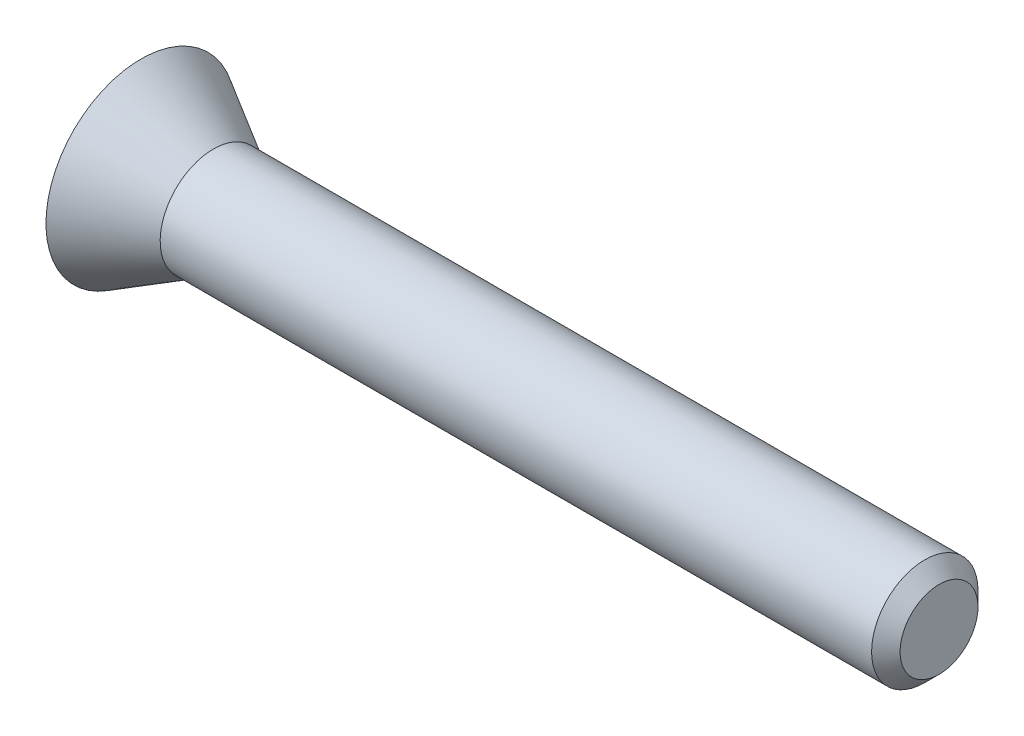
ISO-10303-21;
HEADER;
FILE_DESCRIPTION(('STEP AP214'),'2;1');
FILE_NAME('part.step','',(''),(''),'','','');
FILE_SCHEMA(('AUTOMOTIVE_DESIGN { 1 0 10303 214 1 1 1 1 }'));
ENDSEC;
DATA;
#1=APPLICATION_CONTEXT('core data for automotive mechanical design processes');
#2=APPLICATION_PROTOCOL_DEFINITION('international standard','automotive_design',2000,#1);
#3=PRODUCT_CONTEXT('',#1,'mechanical');
#4=PRODUCT('Part','Part','',(#3));
#5=PRODUCT_RELATED_PRODUCT_CATEGORY('part','',(#4));
#6=PRODUCT_DEFINITION_FORMATION('','',#4);
#7=PRODUCT_DEFINITION_CONTEXT('part definition',#1,'design');
#8=PRODUCT_DEFINITION('design','',#6,#7);
#9=PRODUCT_DEFINITION_SHAPE('','',#8);
#10=(LENGTH_UNIT() NAMED_UNIT(*) SI_UNIT(.MILLI.,.METRE.));
#11=(NAMED_UNIT(*) PLANE_ANGLE_UNIT() SI_UNIT($,.RADIAN.));
#12=(NAMED_UNIT(*) SI_UNIT($,.STERADIAN.) SOLID_ANGLE_UNIT());
#13=UNCERTAINTY_MEASURE_WITH_UNIT(LENGTH_MEASURE(1.E-05),#10,'distance_accuracy_value','');
#14=(GEOMETRIC_REPRESENTATION_CONTEXT(3) GLOBAL_UNCERTAINTY_ASSIGNED_CONTEXT((#13)) GLOBAL_UNIT_ASSIGNED_CONTEXT((#10,
#11,#12)) REPRESENTATION_CONTEXT('',''));
#15=CARTESIAN_POINT('',(0.,0.,0.));
#16=DIRECTION('',(0.,0.,1.));
#17=DIRECTION('',(1.,0.,0.));
#18=AXIS2_PLACEMENT_3D('',#15,#16,#17);
#19=CARTESIAN_POINT('',(-5.25,0.,0.));
#20=DIRECTION('',(1.,0.,0.));
#21=DIRECTION('',(0.,0.,-1.));
#22=AXIS2_PLACEMENT_3D('',#19,#20,#21);
#23=PLANE('',#22);
#24=DIRECTION('',(0.,-1.,0.));
#25=VECTOR('',#24,1.);
#26=CARTESIAN_POINT('',(-5.25,0.4,-0.846897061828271));
#27=LINE('',#26,#25);
#28=CARTESIAN_POINT('',(-5.25,0.4,-0.846897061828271));
#29=VERTEX_POINT('',#28);
#30=CARTESIAN_POINT('',(-5.25,0.274594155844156,-0.846897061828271));
#31=VERTEX_POINT('',#30);
#32=EDGE_CURVE('E300',#29,#31,#27,.T.);
#33=ORIENTED_EDGE('',*,*,#32,.F.);
#34=DIRECTION('',(0.,0.,-1.));
#35=VECTOR('',#34,1.);
#36=CARTESIAN_POINT('',(-5.25,0.4,-0.277903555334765));
#37=LINE('',#36,#35);
#38=CARTESIAN_POINT('',(-5.25,0.4,-0.277903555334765));
#39=VERTEX_POINT('',#38);
#40=EDGE_CURVE('E56',#39,#29,#37,.T.);
#41=ORIENTED_EDGE('',*,*,#40,.F.);
#42=DIRECTION('',(0.,1.,0.));
#43=VECTOR('',#42,1.);
#44=CARTESIAN_POINT('',(-5.25,0.0623376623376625,-0.277903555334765));
#45=LINE('',#44,#43);
#46=CARTESIAN_POINT('',(-5.25,0.0623376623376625,-0.277903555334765));
#47=VERTEX_POINT('',#46);
#48=EDGE_CURVE('E277',#47,#39,#45,.T.);
#49=ORIENTED_EDGE('',*,*,#48,.F.);
#50=DIRECTION('',(0.,0.,1.));
#51=VECTOR('',#50,1.);
#52=CARTESIAN_POINT('',(-5.25,0.0623376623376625,-0.465606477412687));
#53=LINE('',#52,#51);
#54=CARTESIAN_POINT('',(-5.25,0.0623376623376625,-0.465606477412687));
#55=VERTEX_POINT('',#54);
#56=EDGE_CURVE('E280',#55,#47,#53,.T.);
#57=ORIENTED_EDGE('',*,*,#56,.F.);
#58=DIRECTION('',(0.,-1.,0.));
#59=VECTOR('',#58,1.);
#60=CARTESIAN_POINT('',(-5.25,0.218181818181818,-0.465606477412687));
#61=LINE('',#60,#59);
#62=CARTESIAN_POINT('',(-5.25,0.218181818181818,-0.465606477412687));
#63=VERTEX_POINT('',#62);
#64=EDGE_CURVE('E314',#63,#55,#61,.T.);
#65=ORIENTED_EDGE('',*,*,#64,.F.);
#66=DIRECTION('',(0.,0.,1.));
#67=VECTOR('',#66,1.);
#68=CARTESIAN_POINT('',(-5.25,0.218181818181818,-0.636669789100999));
#69=LINE('',#68,#67);
#70=CARTESIAN_POINT('',(-5.25,0.218181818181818,-0.636669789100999));
#71=VERTEX_POINT('',#70);
#72=EDGE_CURVE('E311',#71,#63,#69,.T.);
#73=ORIENTED_EDGE('',*,*,#72,.F.);
#74=DIRECTION('',(0.,0.966781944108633,-0.255602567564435));
#75=VECTOR('',#74,1.);
#76=CARTESIAN_POINT('',(-5.25,-0.6,-0.420354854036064));
#77=LINE('',#76,#75);
#78=CARTESIAN_POINT('',(-5.25,-0.6,-0.420354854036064));
#79=VERTEX_POINT('',#78);
#80=EDGE_CURVE('E308',#79,#71,#77,.T.);
#81=ORIENTED_EDGE('',*,*,#80,.F.);
#82=DIRECTION('',(0.,0.,1.));
#83=VECTOR('',#82,1.);
#84=CARTESIAN_POINT('',(-5.25,-0.6,-0.623682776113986));
#85=LINE('',#84,#83);
#86=CARTESIAN_POINT('',(-5.25,-0.6,-0.623682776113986));
#87=VERTEX_POINT('',#86);
#88=EDGE_CURVE('E305',#87,#79,#85,.T.);
#89=ORIENTED_EDGE('',*,*,#88,.F.);
#90=DIRECTION('',(0.,-0.968940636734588,0.247293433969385));
#91=VECTOR('',#90,1.);
#92=CARTESIAN_POINT('',(-5.25,0.274594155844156,-0.846897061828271));
#93=LINE('',#92,#91);
#94=EDGE_CURVE('E302',#31,#87,#93,.T.);
#95=ORIENTED_EDGE('',*,*,#94,.F.);
#96=EDGE_LOOP('',(#33,#41,#49,#57,#65,#73,#81,#89,#95));
#97=FACE_BOUND('',#96,.T.);
#98=DIRECTION('',(0.,1.,0.));
#99=VECTOR('',#98,1.);
#100=CARTESIAN_POINT('',(-5.25,-0.6,0.88127663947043));
#101=LINE('',#100,#99);
#102=CARTESIAN_POINT('',(-5.25,-0.6,0.88127663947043));
#103=VERTEX_POINT('',#102);
#104=CARTESIAN_POINT('',(-5.25,-0.429951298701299,0.88127663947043));
#105=VERTEX_POINT('',#104);
#106=EDGE_CURVE('E429',#103,#105,#101,.T.);
#107=ORIENTED_EDGE('',*,*,#106,.F.);
#108=DIRECTION('',(0.,0.,1.));
#109=VECTOR('',#108,1.);
#110=CARTESIAN_POINT('',(-5.25,-0.6,0.292396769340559));
#111=LINE('',#110,#109);
#112=CARTESIAN_POINT('',(-5.25,-0.6,0.292396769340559));
#113=VERTEX_POINT('',#112);
#114=EDGE_CURVE('E64',#113,#103,#111,.T.);
#115=ORIENTED_EDGE('',*,*,#114,.F.);
#116=DIRECTION('',(0.,-1.,0.));
#117=VECTOR('',#116,1.);
#118=CARTESIAN_POINT('',(-5.25,-0.418181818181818,0.292396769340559));
#119=LINE('',#118,#117);
#120=CARTESIAN_POINT('',(-5.25,-0.418181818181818,0.292396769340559));
#121=VERTEX_POINT('',#120);
#122=EDGE_CURVE('E338',#121,#113,#119,.T.);
#123=ORIENTED_EDGE('',*,*,#122,.F.);
#124=DIRECTION('',(0.,0.,-1.));
#125=VECTOR('',#124,1.);
#126=CARTESIAN_POINT('',(-5.25,-0.418181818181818,0.632697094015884));
#127=LINE('',#126,#125);
#128=CARTESIAN_POINT('',(-5.25,-0.418181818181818,0.632697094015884));
#129=VERTEX_POINT('',#128);
#130=EDGE_CURVE('E537',#129,#121,#127,.T.);
#131=ORIENTED_EDGE('',*,*,#130,.F.);
#132=DIRECTION('',(0.,-0.78603413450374,0.618183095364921));
#133=VECTOR('',#132,1.);
#134=CARTESIAN_POINT('',(-5.25,-0.106493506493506,0.387567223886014));
#135=LINE('',#134,#133);
#136=CARTESIAN_POINT('',(-5.25,-0.106493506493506,0.387567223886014));
#137=VERTEX_POINT('',#136);
#138=EDGE_CURVE('E540',#137,#129,#135,.T.);
#139=ORIENTED_EDGE('',*,*,#138,.F.);
#140=CARTESIAN_POINT('',(-5.25,0.150811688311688,0.297875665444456));
#141=CARTESIAN_POINT('',(-5.25,0.13943354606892,0.298134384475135));
#142=CARTESIAN_POINT('',(-5.25,0.116657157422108,0.298652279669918));
#143=CARTESIAN_POINT('',(-5.25,0.0825691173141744,0.303327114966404));
#144=CARTESIAN_POINT('',(-5.25,0.048655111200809,0.310860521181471));
#145=CARTESIAN_POINT('',(-5.25,0.0150789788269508,0.321206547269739));
#146=CARTESIAN_POINT('',(-5.25,-0.017577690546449,0.334058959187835));
#147=CARTESIAN_POINT('',(-5.25,-0.0488676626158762,0.349484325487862));
#148=CARTESIAN_POINT('',(-5.25,-0.0788047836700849,0.366893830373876));
#149=CARTESIAN_POINT('',(-5.25,-0.0972816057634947,0.380689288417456));
#150=CARTESIAN_POINT('',(-5.25,-0.106493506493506,0.387567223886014));
#151=B_SPLINE_CURVE_WITH_KNOTS('',3,(#140,#141,#142,#143,#144,#145,#146,#147,#148,#149,#150),
.UNSPECIFIED.,.F.,.F.,(4,1,1,1,1,1,1,1,4),(0.,0.123046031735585,0.246309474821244,
0.371480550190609,0.498560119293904,0.626024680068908,0.750715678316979,0.875715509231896,1.),.UNSPECIFIED.);
#152=CARTESIAN_POINT('',(-5.25,0.150811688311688,0.297875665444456));
#153=VERTEX_POINT('',#152);
#154=EDGE_CURVE('E543',#153,#137,#151,.T.);
#155=ORIENTED_EDGE('',*,*,#154,.F.);
#156=DIRECTION('',(0.,-1.,0.));
#157=VECTOR('',#156,1.);
#158=CARTESIAN_POINT('',(-5.25,0.151623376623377,0.297875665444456));
#159=LINE('',#158,#157);
#160=CARTESIAN_POINT('',(-5.25,0.151623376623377,0.297875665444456));
#161=VERTEX_POINT('',#160);
#162=EDGE_CURVE('E548',#161,#153,#159,.T.);
#163=ORIENTED_EDGE('',*,*,#162,.F.);
#164=CARTESIAN_POINT('',(-5.25,0.412987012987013,0.592315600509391));
#165=CARTESIAN_POINT('',(-5.25,0.412825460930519,0.580942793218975));
#166=CARTESIAN_POINT('',(-5.25,0.412511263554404,0.55882418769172));
#167=CARTESIAN_POINT('',(-5.25,0.409119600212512,0.526623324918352));
#168=CARTESIAN_POINT('',(-5.25,0.404000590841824,0.496325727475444));
#169=CARTESIAN_POINT('',(-5.25,0.396511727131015,0.46798014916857));
#170=CARTESIAN_POINT('',(-5.25,0.386743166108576,0.441700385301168));
#171=CARTESIAN_POINT('',(-5.25,0.374964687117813,0.417407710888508));
#172=CARTESIAN_POINT('',(-5.25,0.361075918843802,0.39505134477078));
#173=CARTESIAN_POINT('',(-5.25,0.345047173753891,0.374802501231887));
#174=CARTESIAN_POINT('',(-5.25,0.327169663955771,0.356583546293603));
#175=CARTESIAN_POINT('',(-5.25,0.307261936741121,0.340901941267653));
#176=CARTESIAN_POINT('',(-5.25,0.285726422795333,0.327326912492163));
#177=CARTESIAN_POINT('',(-5.25,0.262145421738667,0.31671540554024));
#178=CARTESIAN_POINT('',(-5.25,0.237073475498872,0.307979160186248));
#179=CARTESIAN_POINT('',(-5.25,0.210061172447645,0.302322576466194));
#180=CARTESIAN_POINT('',(-5.25,0.181426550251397,0.29851075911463));
#181=CARTESIAN_POINT('',(-5.25,0.161715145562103,0.298090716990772));
#182=CARTESIAN_POINT('',(-5.25,0.151623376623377,0.297875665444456));
#183=B_SPLINE_CURVE_WITH_KNOTS('',3,(#164,#165,#166,#167,#168,#169,#170,#171,#172,#173,#174,
#175,#176,#177,#178,#179,#180,#181,#182),.UNSPECIFIED.,.F.,.F.,(4,1,1,1,1,1,1,1,1,1,1,1,1,1,1,1,
4),(0.,0.0762312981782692,0.148259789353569,0.216860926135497,0.28210063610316,
0.344528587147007,0.404571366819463,0.462840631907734,0.520642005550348,0.577409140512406,
0.633580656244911,0.690215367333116,0.747647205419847,0.806597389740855,0.867894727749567,
0.932365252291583,1.),.UNSPECIFIED.);
#184=CARTESIAN_POINT('',(-5.25,0.412987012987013,0.592315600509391));
#185=VERTEX_POINT('',#184);
#186=EDGE_CURVE('E554',#185,#161,#183,.T.);
#187=ORIENTED_EDGE('',*,*,#186,.F.);
#188=CARTESIAN_POINT('',(-5.25,0.11286525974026,0.893654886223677));
#189=CARTESIAN_POINT('',(-5.25,0.1244566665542,0.892705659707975));
#190=CARTESIAN_POINT('',(-5.25,0.147082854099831,0.890852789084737));
#191=CARTESIAN_POINT('',(-5.25,0.179812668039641,0.884778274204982));
#192=CARTESIAN_POINT('',(-5.25,0.21064191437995,0.876927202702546));
#193=CARTESIAN_POINT('',(-5.25,0.239564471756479,0.866939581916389));
#194=CARTESIAN_POINT('',(-5.25,0.26624544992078,0.854105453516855));
#195=CARTESIAN_POINT('',(-5.25,0.291242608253,0.839685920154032));
#196=CARTESIAN_POINT('',(-5.25,0.313782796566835,0.82234283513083));
#197=CARTESIAN_POINT('',(-5.25,0.334620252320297,0.803358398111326));
#198=CARTESIAN_POINT('',(-5.25,0.352973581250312,0.782213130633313));
#199=CARTESIAN_POINT('',(-5.25,0.369163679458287,0.759666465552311));
#200=CARTESIAN_POINT('',(-5.25,0.382636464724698,0.735377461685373));
#201=CARTESIAN_POINT('',(-5.25,0.393812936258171,0.709715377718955));
#202=CARTESIAN_POINT('',(-5.25,0.402295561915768,0.682395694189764));
#203=CARTESIAN_POINT('',(-5.25,0.408649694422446,0.653775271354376));
#204=CARTESIAN_POINT('',(-5.25,0.412314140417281,0.623525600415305));
#205=CARTESIAN_POINT('',(-5.25,0.412759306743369,0.602877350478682));
#206=CARTESIAN_POINT('',(-5.25,0.412987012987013,0.592315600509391));
#207=B_SPLINE_CURVE_WITH_KNOTS('',3,(#188,#189,#190,#191,#192,#193,#194,#195,#196,#197,#198,
#199,#200,#201,#202,#203,#204,#205,#206),.UNSPECIFIED.,.F.,.F.,(4,1,1,1,1,1,1,1,1,1,1,1,1,1,1,1,
4),(0.,0.0733268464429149,0.143132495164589,0.209679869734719,0.273918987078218,
0.33576228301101,0.396210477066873,0.45560885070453,0.514796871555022,0.573764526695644,
0.631900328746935,0.689592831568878,0.748648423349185,0.808163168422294,0.86976604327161,
0.933384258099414,1.),.UNSPECIFIED.);
#208=CARTESIAN_POINT('',(-5.25,0.11286525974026,0.893654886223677));
#209=VERTEX_POINT('',#208);
#210=EDGE_CURVE('E559',#209,#185,#207,.T.);
#211=ORIENTED_EDGE('',*,*,#210,.F.);
#212=DIRECTION('',(0.,1.,0.));
#213=VECTOR('',#212,1.);
#214=CARTESIAN_POINT('',(-5.25,0.112256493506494,0.893654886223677));
#215=LINE('',#214,#213);
#216=CARTESIAN_POINT('',(-5.25,0.112256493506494,0.893654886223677));
#217=VERTEX_POINT('',#216);
#218=EDGE_CURVE('E567',#217,#209,#215,.T.);
#219=ORIENTED_EDGE('',*,*,#218,.F.);
#220=DIRECTION('',(0.,0.,1.));
#221=VECTOR('',#220,1.);
#222=CARTESIAN_POINT('',(-5.25,0.112256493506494,0.701284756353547));
#223=LINE('',#222,#221);
#224=CARTESIAN_POINT('',(-5.25,0.112256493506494,0.701284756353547));
#225=VERTEX_POINT('',#224);
#226=EDGE_CURVE('E573',#225,#217,#223,.T.);
#227=ORIENTED_EDGE('',*,*,#226,.F.);
#228=DIRECTION('',(0.,-1.,0.));
#229=VECTOR('',#228,1.);
#230=CARTESIAN_POINT('',(-5.25,0.11286525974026,0.701284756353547));
#231=LINE('',#230,#229);
#232=CARTESIAN_POINT('',(-5.25,0.11286525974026,0.701284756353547));
#233=VERTEX_POINT('',#232);
#234=EDGE_CURVE('E576',#233,#225,#231,.T.);
#235=ORIENTED_EDGE('',*,*,#234,.F.);
#236=CARTESIAN_POINT('',(-5.25,0.231168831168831,0.590895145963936));
#237=CARTESIAN_POINT('',(-5.25,0.230881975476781,0.598246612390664));
#238=CARTESIAN_POINT('',(-5.25,0.230324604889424,0.612530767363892));
#239=CARTESIAN_POINT('',(-5.25,0.224147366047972,0.632752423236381));
#240=CARTESIAN_POINT('',(-5.25,0.214457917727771,0.65097410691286));
#241=CARTESIAN_POINT('',(-5.25,0.200632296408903,0.666682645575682));
#242=CARTESIAN_POINT('',(-5.25,0.183273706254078,0.679690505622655));
#243=CARTESIAN_POINT('',(-5.25,0.162832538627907,0.690247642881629));
#244=CARTESIAN_POINT('',(-5.25,0.138939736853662,0.697417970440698));
#245=CARTESIAN_POINT('',(-5.25,0.121836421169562,0.699954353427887));
#246=CARTESIAN_POINT('',(-5.25,0.11286525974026,0.701284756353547));
#247=B_SPLINE_CURVE_WITH_KNOTS('',3,(#236,#237,#238,#239,#240,#241,#242,#243,#244,#245,#246),
.UNSPECIFIED.,.F.,.F.,(4,1,1,1,1,1,1,1,4),(0.,0.122603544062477,0.238222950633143,
0.350089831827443,0.465559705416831,0.58502806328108,0.711014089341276,0.848418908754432,1.),.UNSPECIFIED.);
#248=CARTESIAN_POINT('',(-5.25,0.231168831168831,0.590895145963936));
#249=VERTEX_POINT('',#248);
#250=EDGE_CURVE('E579',#249,#233,#247,.T.);
#251=ORIENTED_EDGE('',*,*,#250,.F.);
#252=CARTESIAN_POINT('',(-5.25,0.146347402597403,0.491057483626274));
#253=CARTESIAN_POINT('',(-5.25,0.152741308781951,0.49133468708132));
#254=CARTESIAN_POINT('',(-5.25,0.1649910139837,0.491865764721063));
#255=CARTESIAN_POINT('',(-5.25,0.182251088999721,0.49686934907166));
#256=CARTESIAN_POINT('',(-5.25,0.197281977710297,0.505069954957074));
#257=CARTESIAN_POINT('',(-5.25,0.209697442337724,0.516815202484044));
#258=CARTESIAN_POINT('',(-5.25,0.219517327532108,0.531437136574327));
#259=CARTESIAN_POINT('',(-5.25,0.22643778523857,0.54893268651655));
#260=CARTESIAN_POINT('',(-5.25,0.230406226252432,0.569072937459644));
#261=CARTESIAN_POINT('',(-5.25,0.230905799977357,0.583368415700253));
#262=CARTESIAN_POINT('',(-5.25,0.231168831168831,0.590895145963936));
#263=B_SPLINE_CURVE_WITH_KNOTS('',3,(#252,#253,#254,#255,#256,#257,#258,#259,#260,#261,#262),
.UNSPECIFIED.,.F.,.F.,(4,1,1,1,1,1,1,1,4),(0.,0.128749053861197,0.246662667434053,
0.359069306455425,0.47107757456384,0.588039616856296,0.711712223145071,0.848213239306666,1.),.UNSPECIFIED.);
#264=CARTESIAN_POINT('',(-5.25,0.146347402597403,0.491057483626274));
#265=VERTEX_POINT('',#264);
#266=EDGE_CURVE('E584',#265,#249,#263,.T.);
#267=ORIENTED_EDGE('',*,*,#266,.F.);
#268=DIRECTION('',(0.,1.,0.));
#269=VECTOR('',#268,1.);
#270=CARTESIAN_POINT('',(-5.25,0.144926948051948,0.491057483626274));
#271=LINE('',#270,#269);
#272=CARTESIAN_POINT('',(-5.25,0.144926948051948,0.491057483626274));
#273=VERTEX_POINT('',#272);
#274=EDGE_CURVE('E592',#273,#265,#271,.T.);
#275=ORIENTED_EDGE('',*,*,#274,.F.);
#276=CARTESIAN_POINT('',(-5.25,0.0227678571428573,0.539555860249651));
#277=CARTESIAN_POINT('',(-5.25,0.0328530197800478,0.532398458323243));
#278=CARTESIAN_POINT('',(-5.25,0.0525036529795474,0.518452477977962));
#279=CARTESIAN_POINT('',(-5.25,0.079489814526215,0.505830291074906));
#280=CARTESIAN_POINT('',(-5.25,0.100647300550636,0.497967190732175));
#281=CARTESIAN_POINT('',(-5.25,0.115990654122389,0.494219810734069));
#282=CARTESIAN_POINT('',(-5.25,0.130629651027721,0.491546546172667));
#283=CARTESIAN_POINT('',(-5.25,0.140248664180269,0.491217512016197));
#284=CARTESIAN_POINT('',(-5.25,0.144926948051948,0.491057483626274));
#285=B_SPLINE_CURVE_WITH_KNOTS('',3,(#276,#277,#278,#279,#280,#281,#282,#283,#284),
.UNSPECIFIED.,.F.,.F.,(4,1,1,1,1,1,4),(0.,0.277375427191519,0.540457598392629,0.666416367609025,
0.784009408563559,0.894951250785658,1.),.UNSPECIFIED.);
#286=CARTESIAN_POINT('',(-5.25,0.0227678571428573,0.539555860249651));
#287=VERTEX_POINT('',#286);
#288=EDGE_CURVE('E598',#287,#273,#285,.T.);
#289=ORIENTED_EDGE('',*,*,#288,.F.);
#290=DIRECTION('',(0.,0.798150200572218,-0.602458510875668));
#291=VECTOR('',#290,1.);
#292=CARTESIAN_POINT('',(-5.25,-0.429951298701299,0.88127663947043));
#293=LINE('',#292,#291);
#294=EDGE_CURVE('E603',#105,#287,#293,.T.);
#295=ORIENTED_EDGE('',*,*,#294,.F.);
#296=EDGE_LOOP('',(#107,#115,#123,#131,#139,#155,#163,#187,#211,#219,#227,#235,#251,#267,#275,
#289,#295));
#297=FACE_BOUND('',#296,.T.);
#298=DIRECTION('',(0.,1.,0.));
#299=VECTOR('',#298,1.);
#300=CARTESIAN_POINT('',(-5.25,0.55,0.125));
#301=LINE('',#300,#299);
#302=CARTESIAN_POINT('',(-5.25,-0.825,0.125));
#303=VERTEX_POINT('',#302);
#304=CARTESIAN_POINT('',(-5.25,0.55,0.125));
#305=VERTEX_POINT('',#304);
#306=EDGE_CURVE('E435',#303,#305,#301,.T.);
#307=ORIENTED_EDGE('',*,*,#306,.F.);
#308=CARTESIAN_POINT('',(-5.25,-0.825,0.));
#309=DIRECTION('',(-1.,0.,0.));
#310=DIRECTION('',(0.,0.,1.));
#311=AXIS2_PLACEMENT_3D('',#308,#309,#310);
#312=CIRCLE('',#311,0.125);
#313=CARTESIAN_POINT('',(-5.25,-0.825,-0.125));
#314=VERTEX_POINT('',#313);
#315=EDGE_CURVE('E479',#314,#303,#312,.T.);
#316=ORIENTED_EDGE('',*,*,#315,.F.);
#317=DIRECTION('',(0.,-1.,0.));
#318=VECTOR('',#317,1.);
#319=CARTESIAN_POINT('',(-5.25,0.55,-0.125));
#320=LINE('',#319,#318);
#321=CARTESIAN_POINT('',(-5.25,0.55,-0.125));
#322=VERTEX_POINT('',#321);
#323=EDGE_CURVE('E462',#322,#314,#320,.T.);
#324=ORIENTED_EDGE('',*,*,#323,.F.);
#325=DIRECTION('',(0.,0.,1.));
#326=VECTOR('',#325,1.);
#327=CARTESIAN_POINT('',(-5.25,0.55,-0.3));
#328=LINE('',#327,#326);
#329=CARTESIAN_POINT('',(-5.25,0.55,-0.3));
#330=VERTEX_POINT('',#329);
#331=EDGE_CURVE('E466',#330,#322,#328,.T.);
#332=ORIENTED_EDGE('',*,*,#331,.F.);
#333=DIRECTION('',(0.,-0.857492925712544,-0.514495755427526));
#334=VECTOR('',#333,1.);
#335=CARTESIAN_POINT('',(-5.25,1.05,0.));
#336=LINE('',#335,#334);
#337=CARTESIAN_POINT('',(-5.25,1.05,0.));
#338=VERTEX_POINT('',#337);
#339=EDGE_CURVE('E469',#338,#330,#336,.T.);
#340=ORIENTED_EDGE('',*,*,#339,.F.);
#341=DIRECTION('',(0.,0.857492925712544,-0.514495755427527));
#342=VECTOR('',#341,1.);
#343=CARTESIAN_POINT('',(-5.25,1.05,0.));
#344=LINE('',#343,#342);
#345=CARTESIAN_POINT('',(-5.25,0.55,0.3));
#346=VERTEX_POINT('',#345);
#347=EDGE_CURVE('E472',#346,#338,#344,.T.);
#348=ORIENTED_EDGE('',*,*,#347,.F.);
#349=DIRECTION('',(0.,0.,1.));
#350=VECTOR('',#349,1.);
#351=CARTESIAN_POINT('',(-5.25,0.55,0.3));
#352=LINE('',#351,#350);
#353=EDGE_CURVE('E475',#305,#346,#352,.T.);
#354=ORIENTED_EDGE('',*,*,#353,.F.);
#355=EDGE_LOOP('',(#307,#316,#324,#332,#340,#348,#354));
#356=FACE_BOUND('',#355,.T.);
#357=CARTESIAN_POINT('',(-5.24999999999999,0.,0.));
#358=DIRECTION('',(-1.,0.,0.));
#359=DIRECTION('',(0.,-1.,0.));
#360=AXIS2_PLACEMENT_3D('',#357,#358,#359);
#361=CIRCLE('',#360,1.25);
#362=CARTESIAN_POINT('',(-5.24999999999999,-1.25,0.));
#363=VERTEX_POINT('',#362);
#364=EDGE_CURVE('E438',#363,#363,#361,.T.);
#365=ORIENTED_EDGE('',*,*,#364,.T.);
#366=EDGE_LOOP('',(#365));
#367=FACE_BOUND('',#366,.T.);
#368=ADVANCED_FACE('F41',(#97,#297,#356,#367),#23,.F.);
#369=CARTESIAN_POINT('',(-5.24999999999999,0.,0.));
#370=DIRECTION('',(-1.,0.,0.));
#371=DIRECTION('',(0.,-1.,0.));
#372=AXIS2_PLACEMENT_3D('',#369,#370,#371);
#373=CONICAL_SURFACE('',#372,1.25,0.523598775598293);
#374=CARTESIAN_POINT('',(-4.2973720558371,0.,0.));
#375=DIRECTION('',(-1.,0.,0.));
#376=DIRECTION('',(0.,-1.,0.));
#377=AXIS2_PLACEMENT_3D('',#374,#375,#376);
#378=CIRCLE('',#377,0.7);
#379=CARTESIAN_POINT('',(-4.2973720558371,-0.7,0.));
#380=VERTEX_POINT('',#379);
#381=EDGE_CURVE('E440',#380,#380,#378,.T.);
#382=ORIENTED_EDGE('',*,*,#381,.T.);
#383=EDGE_LOOP('',(#382));
#384=FACE_BOUND('',#383,.T.);
#385=ORIENTED_EDGE('',*,*,#364,.F.);
#386=EDGE_LOOP('',(#385));
#387=FACE_BOUND('',#386,.T.);
#388=ADVANCED_FACE('F412',(#384,#387),#373,.T.);
#389=CARTESIAN_POINT('',(-5.25,0.,0.));
#390=DIRECTION('',(-1.,0.,0.));
#391=DIRECTION('',(0.,-1.,0.));
#392=AXIS2_PLACEMENT_3D('',#389,#390,#391);
#393=CYLINDRICAL_SURFACE('',#392,0.7);
#394=CARTESIAN_POINT('',(5.0625,0.,0.));
#395=DIRECTION('',(1.,0.,0.));
#396=DIRECTION('',(0.,1.,0.));
#397=AXIS2_PLACEMENT_3D('',#394,#395,#396);
#398=CIRCLE('',#397,0.7);
#399=CARTESIAN_POINT('',(5.0625,0.7,0.));
#400=VERTEX_POINT('',#399);
#401=EDGE_CURVE('E49',#400,#400,#398,.F.);
#402=ORIENTED_EDGE('',*,*,#401,.T.);
#403=EDGE_LOOP('',(#402));
#404=FACE_BOUND('',#403,.T.);
#405=ORIENTED_EDGE('',*,*,#381,.F.);
#406=EDGE_LOOP('',(#405));
#407=FACE_BOUND('',#406,.T.);
#408=ADVANCED_FACE('F409',(#404,#407),#393,.T.);
#409=CARTESIAN_POINT('',(5.25,0.,0.));
#410=DIRECTION('',(1.,0.,0.));
#411=DIRECTION('',(0.,0.,-1.));
#412=AXIS2_PLACEMENT_3D('',#409,#410,#411);
#413=PLANE('',#412);
#414=CARTESIAN_POINT('',(5.25,0.,0.));
#415=DIRECTION('',(1.,0.,0.));
#416=DIRECTION('',(0.,0.,-1.));
#417=AXIS2_PLACEMENT_3D('',#414,#415,#416);
#418=CIRCLE('',#417,0.512499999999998);
#419=CARTESIAN_POINT('',(5.25,0.,-0.512499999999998));
#420=VERTEX_POINT('',#419);
#421=EDGE_CURVE('E11',#420,#420,#418,.T.);
#422=ORIENTED_EDGE('',*,*,#421,.T.);
#423=EDGE_LOOP('',(#422));
#424=FACE_BOUND('',#423,.T.);
#425=ADVANCED_FACE('F407',(#424),#413,.T.);
#426=CARTESIAN_POINT('',(-4.95,-0.825,0.));
#427=DIRECTION('',(-1.,0.,0.));
#428=DIRECTION('',(0.,0.,1.));
#429=AXIS2_PLACEMENT_3D('',#426,#427,#428);
#430=CYLINDRICAL_SURFACE('',#429,0.125);
#431=ORIENTED_EDGE('',*,*,#315,.T.);
#432=DIRECTION('',(-1.,0.,0.));
#433=VECTOR('',#432,1.);
#434=CARTESIAN_POINT('',(-4.95,-0.825,0.125));
#435=LINE('',#434,#433);
#436=CARTESIAN_POINT('',(-4.95,-0.825,0.125));
#437=VERTEX_POINT('',#436);
#438=EDGE_CURVE('E447',#437,#303,#435,.T.);
#439=ORIENTED_EDGE('',*,*,#438,.F.);
#440=CARTESIAN_POINT('',(-4.95,-0.825,0.));
#441=DIRECTION('',(-1.,0.,0.));
#442=DIRECTION('',(0.,0.,1.));
#443=AXIS2_PLACEMENT_3D('',#440,#441,#442);
#444=CIRCLE('',#443,0.125);
#445=CARTESIAN_POINT('',(-4.95,-0.825,-0.125));
#446=VERTEX_POINT('',#445);
#447=EDGE_CURVE('E465',#446,#437,#444,.T.);
#448=ORIENTED_EDGE('',*,*,#447,.F.);
#449=DIRECTION('',(-1.,0.,0.));
#450=VECTOR('',#449,1.);
#451=CARTESIAN_POINT('',(-4.95,-0.825,-0.125));
#452=LINE('',#451,#450);
#453=EDGE_CURVE('E444',#446,#314,#452,.T.);
#454=ORIENTED_EDGE('',*,*,#453,.T.);
#455=EDGE_LOOP('',(#431,#439,#448,#454));
#456=FACE_BOUND('',#455,.T.);
#457=ADVANCED_FACE('F385',(#456),#430,.F.);
#458=CARTESIAN_POINT('',(-4.95,0.55,-0.125));
#459=DIRECTION('',(0.,0.,-1.));
#460=DIRECTION('',(0.,1.,0.));
#461=AXIS2_PLACEMENT_3D('',#458,#459,#460);
#462=PLANE('',#461);
#463=ORIENTED_EDGE('',*,*,#323,.T.);
#464=ORIENTED_EDGE('',*,*,#453,.F.);
#465=DIRECTION('',(0.,-1.,0.));
#466=VECTOR('',#465,1.);
#467=CARTESIAN_POINT('',(-4.95,0.55,-0.125));
#468=LINE('',#467,#466);
#469=CARTESIAN_POINT('',(-4.95,0.55,-0.125));
#470=VERTEX_POINT('',#469);
#471=EDGE_CURVE('E451',#470,#446,#468,.T.);
#472=ORIENTED_EDGE('',*,*,#471,.F.);
#473=DIRECTION('',(-1.,0.,0.));
#474=VECTOR('',#473,1.);
#475=CARTESIAN_POINT('',(-4.95,0.55,-0.125));
#476=LINE('',#475,#474);
#477=EDGE_CURVE('E459',#470,#322,#476,.T.);
#478=ORIENTED_EDGE('',*,*,#477,.T.);
#479=EDGE_LOOP('',(#463,#464,#472,#478));
#480=FACE_BOUND('',#479,.T.);
#481=ADVANCED_FACE('F381',(#480),#462,.F.);
#482=CARTESIAN_POINT('',(-4.95,0.55,-0.3));
#483=DIRECTION('',(0.,-1.,0.));
#484=DIRECTION('',(0.,0.,-1.));
#485=AXIS2_PLACEMENT_3D('',#482,#483,#484);
#486=PLANE('',#485);
#487=ORIENTED_EDGE('',*,*,#331,.T.);
#488=ORIENTED_EDGE('',*,*,#477,.F.);
#489=DIRECTION('',(0.,0.,1.));
#490=VECTOR('',#489,1.);
#491=CARTESIAN_POINT('',(-4.95,0.55,-0.3));
#492=LINE('',#491,#490);
#493=CARTESIAN_POINT('',(-4.95,0.55,-0.3));
#494=VERTEX_POINT('',#493);
#495=EDGE_CURVE('E484',#494,#470,#492,.T.);
#496=ORIENTED_EDGE('',*,*,#495,.F.);
#497=DIRECTION('',(-1.,0.,0.));
#498=VECTOR('',#497,1.);
#499=CARTESIAN_POINT('',(-4.95,0.55,-0.3));
#500=LINE('',#499,#498);
#501=EDGE_CURVE('E457',#494,#330,#500,.T.);
#502=ORIENTED_EDGE('',*,*,#501,.T.);
#503=EDGE_LOOP('',(#487,#488,#496,#502));
#504=FACE_BOUND('',#503,.T.);
#505=ADVANCED_FACE('F384',(#504),#486,.F.);
#506=CARTESIAN_POINT('',(-4.95,1.05,0.));
#507=DIRECTION('',(0.,0.514495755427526,-0.857492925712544));
#508=DIRECTION('',(0.,0.857492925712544,0.514495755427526));
#509=AXIS2_PLACEMENT_3D('',#506,#507,#508);
#510=PLANE('',#509);
#511=ORIENTED_EDGE('',*,*,#339,.T.);
#512=ORIENTED_EDGE('',*,*,#501,.F.);
#513=DIRECTION('',(0.,-0.857492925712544,-0.514495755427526));
#514=VECTOR('',#513,1.);
#515=CARTESIAN_POINT('',(-4.95,1.05,0.));
#516=LINE('',#515,#514);
#517=CARTESIAN_POINT('',(-4.95,1.05,0.));
#518=VERTEX_POINT('',#517);
#519=EDGE_CURVE('E487',#518,#494,#516,.T.);
#520=ORIENTED_EDGE('',*,*,#519,.F.);
#521=DIRECTION('',(-1.,0.,0.));
#522=VECTOR('',#521,1.);
#523=CARTESIAN_POINT('',(-4.95,1.05,0.));
#524=LINE('',#523,#522);
#525=EDGE_CURVE('E455',#518,#338,#524,.T.);
#526=ORIENTED_EDGE('',*,*,#525,.T.);
#527=EDGE_LOOP('',(#511,#512,#520,#526));
#528=FACE_BOUND('',#527,.T.);
#529=ADVANCED_FACE('F389',(#528),#510,.F.);
#530=CARTESIAN_POINT('',(-4.95,1.05,0.));
#531=DIRECTION('',(0.,0.514495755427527,0.857492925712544));
#532=DIRECTION('',(0.,-0.857492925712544,0.514495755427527));
#533=AXIS2_PLACEMENT_3D('',#530,#531,#532);
#534=PLANE('',#533);
#535=ORIENTED_EDGE('',*,*,#347,.T.);
#536=ORIENTED_EDGE('',*,*,#525,.F.);
#537=DIRECTION('',(0.,0.857492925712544,-0.514495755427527));
#538=VECTOR('',#537,1.);
#539=CARTESIAN_POINT('',(-4.95,1.05,0.));
#540=LINE('',#539,#538);
#541=CARTESIAN_POINT('',(-4.95,0.55,0.3));
#542=VERTEX_POINT('',#541);
#543=EDGE_CURVE('E490',#542,#518,#540,.T.);
#544=ORIENTED_EDGE('',*,*,#543,.F.);
#545=DIRECTION('',(-1.,0.,0.));
#546=VECTOR('',#545,1.);
#547=CARTESIAN_POINT('',(-4.95,0.55,0.3));
#548=LINE('',#547,#546);
#549=EDGE_CURVE('E453',#542,#346,#548,.T.);
#550=ORIENTED_EDGE('',*,*,#549,.T.);
#551=EDGE_LOOP('',(#535,#536,#544,#550));
#552=FACE_BOUND('',#551,.T.);
#553=ADVANCED_FACE('F393',(#552),#534,.F.);
#554=CARTESIAN_POINT('',(-4.95,0.55,0.3));
#555=DIRECTION('',(0.,-1.,0.));
#556=DIRECTION('',(0.,0.,-1.));
#557=AXIS2_PLACEMENT_3D('',#554,#555,#556);
#558=PLANE('',#557);
#559=ORIENTED_EDGE('',*,*,#353,.T.);
#560=ORIENTED_EDGE('',*,*,#549,.F.);
#561=DIRECTION('',(0.,0.,1.));
#562=VECTOR('',#561,1.);
#563=CARTESIAN_POINT('',(-4.95,0.55,0.3));
#564=LINE('',#563,#562);
#565=CARTESIAN_POINT('',(-4.95,0.55,0.125));
#566=VERTEX_POINT('',#565);
#567=EDGE_CURVE('E493',#566,#542,#564,.T.);
#568=ORIENTED_EDGE('',*,*,#567,.F.);
#569=DIRECTION('',(-1.,0.,0.));
#570=VECTOR('',#569,1.);
#571=CARTESIAN_POINT('',(-4.95,0.55,0.125));
#572=LINE('',#571,#570);
#573=EDGE_CURVE('E450',#566,#305,#572,.T.);
#574=ORIENTED_EDGE('',*,*,#573,.T.);
#575=EDGE_LOOP('',(#559,#560,#568,#574));
#576=FACE_BOUND('',#575,.T.);
#577=ADVANCED_FACE('F397',(#576),#558,.F.);
#578=CARTESIAN_POINT('',(-4.95,0.55,0.125));
#579=DIRECTION('',(0.,0.,1.));
#580=DIRECTION('',(0.,-1.,0.));
#581=AXIS2_PLACEMENT_3D('',#578,#579,#580);
#582=PLANE('',#581);
#583=ORIENTED_EDGE('',*,*,#306,.T.);
#584=ORIENTED_EDGE('',*,*,#573,.F.);
#585=DIRECTION('',(0.,1.,0.));
#586=VECTOR('',#585,1.);
#587=CARTESIAN_POINT('',(-4.95,0.55,0.125));
#588=LINE('',#587,#586);
#589=EDGE_CURVE('E496',#437,#566,#588,.T.);
#590=ORIENTED_EDGE('',*,*,#589,.F.);
#591=ORIENTED_EDGE('',*,*,#438,.T.);
#592=EDGE_LOOP('',(#583,#584,#590,#591));
#593=FACE_BOUND('',#592,.T.);
#594=ADVANCED_FACE('F379',(#593),#582,.F.);
#595=CARTESIAN_POINT('',(-4.95,-0.825,0.));
#596=DIRECTION('',(-1.,0.,0.));
#597=DIRECTION('',(0.,0.,1.));
#598=AXIS2_PLACEMENT_3D('',#595,#596,#597);
#599=PLANE('',#598);
#600=ORIENTED_EDGE('',*,*,#447,.T.);
#601=ORIENTED_EDGE('',*,*,#589,.T.);
#602=ORIENTED_EDGE('',*,*,#567,.T.);
#603=ORIENTED_EDGE('',*,*,#543,.T.);
#604=ORIENTED_EDGE('',*,*,#519,.T.);
#605=ORIENTED_EDGE('',*,*,#495,.T.);
#606=ORIENTED_EDGE('',*,*,#471,.T.);
#607=EDGE_LOOP('',(#600,#601,#602,#603,#604,#605,#606));
#608=FACE_BOUND('',#607,.T.);
#609=ADVANCED_FACE('F376',(#608),#599,.T.);
#610=CARTESIAN_POINT('',(5.0625,0.,0.));
#611=DIRECTION('',(-1.,0.,0.));
#612=DIRECTION('',(0.,-1.,0.));
#613=AXIS2_PLACEMENT_3D('',#610,#611,#612);
#614=CONICAL_SURFACE('',#613,0.7,0.78539816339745);
#615=ORIENTED_EDGE('',*,*,#421,.F.);
#616=EDGE_LOOP('',(#615));
#617=FACE_BOUND('',#616,.T.);
#618=ORIENTED_EDGE('',*,*,#401,.F.);
#619=EDGE_LOOP('',(#618));
#620=FACE_BOUND('',#619,.T.);
#621=ADVANCED_FACE('F43',(#617,#620),#614,.T.);
#622=CARTESIAN_POINT('',(-4.95,-0.6,0.292396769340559));
#623=DIRECTION('',(0.,-1.,0.));
#624=DIRECTION('',(0.,0.,-1.));
#625=AXIS2_PLACEMENT_3D('',#622,#623,#624);
#626=PLANE('',#625);
#627=ORIENTED_EDGE('',*,*,#114,.T.);
#628=DIRECTION('',(-1.,0.,0.));
#629=VECTOR('',#628,1.);
#630=CARTESIAN_POINT('',(-4.95,-0.6,0.88127663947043));
#631=LINE('',#630,#629);
#632=CARTESIAN_POINT('',(-4.95,-0.6,0.88127663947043));
#633=VERTEX_POINT('',#632);
#634=EDGE_CURVE('E501',#633,#103,#631,.T.);
#635=ORIENTED_EDGE('',*,*,#634,.F.);
#636=DIRECTION('',(0.,0.,1.));
#637=VECTOR('',#636,1.);
#638=CARTESIAN_POINT('',(-4.95,-0.6,0.292396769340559));
#639=LINE('',#638,#637);
#640=CARTESIAN_POINT('',(-4.95,-0.6,0.292396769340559));
#641=VERTEX_POINT('',#640);
#642=EDGE_CURVE('E334',#641,#633,#639,.T.);
#643=ORIENTED_EDGE('',*,*,#642,.F.);
#644=DIRECTION('',(-1.,0.,0.));
#645=VECTOR('',#644,1.);
#646=CARTESIAN_POINT('',(-4.95,-0.6,0.292396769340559));
#647=LINE('',#646,#645);
#648=EDGE_CURVE('E481',#641,#113,#647,.T.);
#649=ORIENTED_EDGE('',*,*,#648,.T.);
#650=EDGE_LOOP('',(#627,#635,#643,#649));
#651=FACE_BOUND('',#650,.T.);
#652=ADVANCED_FACE('F372',(#651),#626,.F.);
#653=CARTESIAN_POINT('',(-4.95,-0.418181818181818,0.292396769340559));
#654=DIRECTION('',(0.,0.,-1.));
#655=DIRECTION('',(-1.,0.,0.));
#656=AXIS2_PLACEMENT_3D('',#653,#654,#655);
#657=PLANE('',#656);
#658=ORIENTED_EDGE('',*,*,#122,.T.);
#659=ORIENTED_EDGE('',*,*,#648,.F.);
#660=DIRECTION('',(0.,-1.,0.));
#661=VECTOR('',#660,1.);
#662=CARTESIAN_POINT('',(-4.95,-0.418181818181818,0.292396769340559));
#663=LINE('',#662,#661);
#664=CARTESIAN_POINT('',(-4.95,-0.418181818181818,0.292396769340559));
#665=VERTEX_POINT('',#664);
#666=EDGE_CURVE('E504',#665,#641,#663,.T.);
#667=ORIENTED_EDGE('',*,*,#666,.F.);
#668=DIRECTION('',(-1.,0.,0.));
#669=VECTOR('',#668,1.);
#670=CARTESIAN_POINT('',(-4.95,-0.418181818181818,0.292396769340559));
#671=LINE('',#670,#669);
#672=EDGE_CURVE('E532',#665,#121,#671,.T.);
#673=ORIENTED_EDGE('',*,*,#672,.T.);
#674=EDGE_LOOP('',(#658,#659,#667,#673));
#675=FACE_BOUND('',#674,.T.);
#676=ADVANCED_FACE('F375',(#675),#657,.F.);
#677=CARTESIAN_POINT('',(-4.95,-0.418181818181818,0.632697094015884));
#678=DIRECTION('',(0.,1.,0.));
#679=DIRECTION('',(0.,0.,1.));
#680=AXIS2_PLACEMENT_3D('',#677,#678,#679);
#681=PLANE('',#680);
#682=ORIENTED_EDGE('',*,*,#130,.T.);
#683=ORIENTED_EDGE('',*,*,#672,.F.);
#684=DIRECTION('',(0.,0.,-1.));
#685=VECTOR('',#684,1.);
#686=CARTESIAN_POINT('',(-4.95,-0.418181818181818,0.632697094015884));
#687=LINE('',#686,#685);
#688=CARTESIAN_POINT('',(-4.95,-0.418181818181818,0.632697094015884));
#689=VERTEX_POINT('',#688);
#690=EDGE_CURVE('E613',#689,#665,#687,.T.);
#691=ORIENTED_EDGE('',*,*,#690,.F.);
#692=DIRECTION('',(-1.,0.,0.));
#693=VECTOR('',#692,1.);
#694=CARTESIAN_POINT('',(-4.95,-0.418181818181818,0.632697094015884));
#695=LINE('',#694,#693);
#696=EDGE_CURVE('E530',#689,#129,#695,.T.);
#697=ORIENTED_EDGE('',*,*,#696,.T.);
#698=EDGE_LOOP('',(#682,#683,#691,#697));
#699=FACE_BOUND('',#698,.T.);
#700=ADVANCED_FACE('F726',(#699),#681,.F.);
#701=CARTESIAN_POINT('',(-4.95,-0.106493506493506,0.387567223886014));
#702=DIRECTION('',(0.,-0.618183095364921,-0.786034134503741));
#703=DIRECTION('',(0.,0.78603413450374,-0.618183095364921));
#704=AXIS2_PLACEMENT_3D('',#701,#702,#703);
#705=PLANE('',#704);
#706=ORIENTED_EDGE('',*,*,#138,.T.);
#707=ORIENTED_EDGE('',*,*,#696,.F.);
#708=DIRECTION('',(0.,-0.78603413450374,0.618183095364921));
#709=VECTOR('',#708,1.);
#710=CARTESIAN_POINT('',(-4.95,-0.106493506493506,0.387567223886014));
#711=LINE('',#710,#709);
#712=CARTESIAN_POINT('',(-4.95,-0.106493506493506,0.387567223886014));
#713=VERTEX_POINT('',#712);
#714=EDGE_CURVE('E616',#713,#689,#711,.T.);
#715=ORIENTED_EDGE('',*,*,#714,.F.);
#716=DIRECTION('',(-1.,0.,0.));
#717=VECTOR('',#716,1.);
#718=CARTESIAN_POINT('',(-4.95,-0.106493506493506,0.387567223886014));
#719=LINE('',#718,#717);
#720=EDGE_CURVE('E528',#713,#137,#719,.T.);
#721=ORIENTED_EDGE('',*,*,#720,.T.);
#722=EDGE_LOOP('',(#706,#707,#715,#721));
#723=FACE_BOUND('',#722,.T.);
#724=ADVANCED_FACE('F636',(#723),#705,.F.);
#725=CARTESIAN_POINT('',(-4.95,0.150811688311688,0.297875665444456));
#726=CARTESIAN_POINT('',(-4.95,0.13943354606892,0.298134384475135));
#727=CARTESIAN_POINT('',(-4.95,0.116657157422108,0.298652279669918));
#728=CARTESIAN_POINT('',(-4.95,0.0825691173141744,0.303327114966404));
#729=CARTESIAN_POINT('',(-4.95,0.048655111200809,0.310860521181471));
#730=CARTESIAN_POINT('',(-4.95,0.0150789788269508,0.321206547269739));
#731=CARTESIAN_POINT('',(-4.95,-0.017577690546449,0.334058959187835));
#732=CARTESIAN_POINT('',(-4.95,-0.0488676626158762,0.349484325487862));
#733=CARTESIAN_POINT('',(-4.95,-0.0788047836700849,0.366893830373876));
#734=CARTESIAN_POINT('',(-4.95,-0.0972816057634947,0.380689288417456));
#735=CARTESIAN_POINT('',(-4.95,-0.106493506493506,0.387567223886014));
#736=B_SPLINE_CURVE_WITH_KNOTS('',3,(#725,#726,#727,#728,#729,#730,#731,#732,#733,#734,#735),
.UNSPECIFIED.,.F.,.F.,(4,1,1,1,1,1,1,1,4),(0.,0.123046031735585,0.246309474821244,
0.371480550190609,0.498560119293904,0.626024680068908,0.750715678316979,0.875715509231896,1.),.UNSPECIFIED.);
#737=DIRECTION('',(-1.,0.,0.));
#738=VECTOR('',#737,1.);
#739=SURFACE_OF_LINEAR_EXTRUSION('',#736,#738);
#740=ORIENTED_EDGE('',*,*,#154,.T.);
#741=ORIENTED_EDGE('',*,*,#720,.F.);
#742=CARTESIAN_POINT('',(-4.95,0.150811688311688,0.297875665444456));
#743=VERTEX_POINT('',#742);
#744=EDGE_CURVE('E619',#743,#713,#736,.T.);
#745=ORIENTED_EDGE('',*,*,#744,.F.);
#746=DIRECTION('',(-1.,0.,0.));
#747=VECTOR('',#746,1.);
#748=CARTESIAN_POINT('',(-4.95,0.150811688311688,0.297875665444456));
#749=LINE('',#748,#747);
#750=EDGE_CURVE('E526',#743,#153,#749,.T.);
#751=ORIENTED_EDGE('',*,*,#750,.T.);
#752=EDGE_LOOP('',(#740,#741,#745,#751));
#753=FACE_BOUND('',#752,.T.);
#754=ADVANCED_FACE('F631',(#753),#739,.F.);
#755=CARTESIAN_POINT('',(-4.95,0.151623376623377,0.297875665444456));
#756=DIRECTION('',(0.,0.,-1.));
#757=DIRECTION('',(-1.,0.,0.));
#758=AXIS2_PLACEMENT_3D('',#755,#756,#757);
#759=PLANE('',#758);
#760=ORIENTED_EDGE('',*,*,#162,.T.);
#761=ORIENTED_EDGE('',*,*,#750,.F.);
#762=DIRECTION('',(0.,-1.,0.));
#763=VECTOR('',#762,1.);
#764=CARTESIAN_POINT('',(-4.95,0.151623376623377,0.297875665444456));
#765=LINE('',#764,#763);
#766=CARTESIAN_POINT('',(-4.95,0.151623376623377,0.297875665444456));
#767=VERTEX_POINT('',#766);
#768=EDGE_CURVE('E625',#767,#743,#765,.T.);
#769=ORIENTED_EDGE('',*,*,#768,.F.);
#770=DIRECTION('',(-1.,0.,0.));
#771=VECTOR('',#770,1.);
#772=CARTESIAN_POINT('',(-4.95,0.151623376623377,0.297875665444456));
#773=LINE('',#772,#771);
#774=EDGE_CURVE('E524',#767,#161,#773,.T.);
#775=ORIENTED_EDGE('',*,*,#774,.T.);
#776=EDGE_LOOP('',(#760,#761,#769,#775));
#777=FACE_BOUND('',#776,.T.);
#778=ADVANCED_FACE('F635',(#777),#759,.F.);
#779=CARTESIAN_POINT('',(-4.95,0.412987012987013,0.592315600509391));
#780=CARTESIAN_POINT('',(-4.95,0.412825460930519,0.580942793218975));
#781=CARTESIAN_POINT('',(-4.95,0.412511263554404,0.55882418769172));
#782=CARTESIAN_POINT('',(-4.95,0.409119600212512,0.526623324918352));
#783=CARTESIAN_POINT('',(-4.95,0.404000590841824,0.496325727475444));
#784=CARTESIAN_POINT('',(-4.95,0.396511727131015,0.46798014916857));
#785=CARTESIAN_POINT('',(-4.95,0.386743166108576,0.441700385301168));
#786=CARTESIAN_POINT('',(-4.95,0.374964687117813,0.417407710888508));
#787=CARTESIAN_POINT('',(-4.95,0.361075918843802,0.39505134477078));
#788=CARTESIAN_POINT('',(-4.95,0.345047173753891,0.374802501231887));
#789=CARTESIAN_POINT('',(-4.95,0.327169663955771,0.356583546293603));
#790=CARTESIAN_POINT('',(-4.95,0.307261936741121,0.340901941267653));
#791=CARTESIAN_POINT('',(-4.95,0.285726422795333,0.327326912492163));
#792=CARTESIAN_POINT('',(-4.95,0.262145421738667,0.31671540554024));
#793=CARTESIAN_POINT('',(-4.95,0.237073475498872,0.307979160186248));
#794=CARTESIAN_POINT('',(-4.95,0.210061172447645,0.302322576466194));
#795=CARTESIAN_POINT('',(-4.95,0.181426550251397,0.29851075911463));
#796=CARTESIAN_POINT('',(-4.95,0.161715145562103,0.298090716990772));
#797=CARTESIAN_POINT('',(-4.95,0.151623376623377,0.297875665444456));
#798=B_SPLINE_CURVE_WITH_KNOTS('',3,(#779,#780,#781,#782,#783,#784,#785,#786,#787,#788,#789,
#790,#791,#792,#793,#794,#795,#796,#797),.UNSPECIFIED.,.F.,.F.,(4,1,1,1,1,1,1,1,1,1,1,1,1,1,1,1,
4),(0.,0.0762312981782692,0.148259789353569,0.216860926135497,0.28210063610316,
0.344528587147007,0.404571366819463,0.462840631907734,0.520642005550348,0.577409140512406,
0.633580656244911,0.690215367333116,0.747647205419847,0.806597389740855,0.867894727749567,
0.932365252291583,1.),.UNSPECIFIED.);
#799=DIRECTION('',(-1.,0.,0.));
#800=VECTOR('',#799,1.);
#801=SURFACE_OF_LINEAR_EXTRUSION('',#798,#800);
#802=ORIENTED_EDGE('',*,*,#186,.T.);
#803=ORIENTED_EDGE('',*,*,#774,.F.);
#804=CARTESIAN_POINT('',(-4.95,0.412987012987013,0.592315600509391));
#805=VERTEX_POINT('',#804);
#806=EDGE_CURVE('E649',#805,#767,#798,.T.);
#807=ORIENTED_EDGE('',*,*,#806,.F.);
#808=DIRECTION('',(-1.,0.,0.));
#809=VECTOR('',#808,1.);
#810=CARTESIAN_POINT('',(-4.95,0.412987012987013,0.592315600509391));
#811=LINE('',#810,#809);
#812=EDGE_CURVE('E522',#805,#185,#811,.T.);
#813=ORIENTED_EDGE('',*,*,#812,.T.);
#814=EDGE_LOOP('',(#802,#803,#807,#813));
#815=FACE_BOUND('',#814,.T.);
#816=ADVANCED_FACE('F641',(#815),#801,.F.);
#817=CARTESIAN_POINT('',(-4.95,0.11286525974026,0.893654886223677));
#818=CARTESIAN_POINT('',(-4.95,0.1244566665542,0.892705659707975));
#819=CARTESIAN_POINT('',(-4.95,0.147082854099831,0.890852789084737));
#820=CARTESIAN_POINT('',(-4.95,0.179812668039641,0.884778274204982));
#821=CARTESIAN_POINT('',(-4.95,0.21064191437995,0.876927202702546));
#822=CARTESIAN_POINT('',(-4.95,0.239564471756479,0.866939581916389));
#823=CARTESIAN_POINT('',(-4.95,0.26624544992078,0.854105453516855));
#824=CARTESIAN_POINT('',(-4.95,0.291242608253,0.839685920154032));
#825=CARTESIAN_POINT('',(-4.95,0.313782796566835,0.82234283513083));
#826=CARTESIAN_POINT('',(-4.95,0.334620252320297,0.803358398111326));
#827=CARTESIAN_POINT('',(-4.95,0.352973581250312,0.782213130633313));
#828=CARTESIAN_POINT('',(-4.95,0.369163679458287,0.759666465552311));
#829=CARTESIAN_POINT('',(-4.95,0.382636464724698,0.735377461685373));
#830=CARTESIAN_POINT('',(-4.95,0.393812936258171,0.709715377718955));
#831=CARTESIAN_POINT('',(-4.95,0.402295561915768,0.682395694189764));
#832=CARTESIAN_POINT('',(-4.95,0.408649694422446,0.653775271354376));
#833=CARTESIAN_POINT('',(-4.95,0.412314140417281,0.623525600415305));
#834=CARTESIAN_POINT('',(-4.95,0.412759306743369,0.602877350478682));
#835=CARTESIAN_POINT('',(-4.95,0.412987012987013,0.592315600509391));
#836=B_SPLINE_CURVE_WITH_KNOTS('',3,(#817,#818,#819,#820,#821,#822,#823,#824,#825,#826,#827,
#828,#829,#830,#831,#832,#833,#834,#835),.UNSPECIFIED.,.F.,.F.,(4,1,1,1,1,1,1,1,1,1,1,1,1,1,1,1,
4),(0.,0.0733268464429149,0.143132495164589,0.209679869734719,0.273918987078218,
0.33576228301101,0.396210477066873,0.45560885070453,0.514796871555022,0.573764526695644,
0.631900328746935,0.689592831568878,0.748648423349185,0.808163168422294,0.86976604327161,
0.933384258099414,1.),.UNSPECIFIED.);
#837=DIRECTION('',(-1.,0.,0.));
#838=VECTOR('',#837,1.);
#839=SURFACE_OF_LINEAR_EXTRUSION('',#836,#838);
#840=ORIENTED_EDGE('',*,*,#210,.T.);
#841=ORIENTED_EDGE('',*,*,#812,.F.);
#842=CARTESIAN_POINT('',(-4.95,0.11286525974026,0.893654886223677));
#843=VERTEX_POINT('',#842);
#844=EDGE_CURVE('E654',#843,#805,#836,.T.);
#845=ORIENTED_EDGE('',*,*,#844,.F.);
#846=DIRECTION('',(-1.,0.,0.));
#847=VECTOR('',#846,1.);
#848=CARTESIAN_POINT('',(-4.95,0.11286525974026,0.893654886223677));
#849=LINE('',#848,#847);
#850=EDGE_CURVE('E520',#843,#209,#849,.T.);
#851=ORIENTED_EDGE('',*,*,#850,.T.);
#852=EDGE_LOOP('',(#840,#841,#845,#851));
#853=FACE_BOUND('',#852,.T.);
#854=ADVANCED_FACE('F645',(#853),#839,.F.);
#855=CARTESIAN_POINT('',(-4.95,0.112256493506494,0.893654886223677));
#856=DIRECTION('',(0.,0.,1.));
#857=DIRECTION('',(1.,0.,0.));
#858=AXIS2_PLACEMENT_3D('',#855,#856,#857);
#859=PLANE('',#858);
#860=ORIENTED_EDGE('',*,*,#218,.T.);
#861=ORIENTED_EDGE('',*,*,#850,.F.);
#862=DIRECTION('',(0.,1.,0.));
#863=VECTOR('',#862,1.);
#864=CARTESIAN_POINT('',(-4.95,0.112256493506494,0.893654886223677));
#865=LINE('',#864,#863);
#866=CARTESIAN_POINT('',(-4.95,0.112256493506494,0.893654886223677));
#867=VERTEX_POINT('',#866);
#868=EDGE_CURVE('E663',#867,#843,#865,.T.);
#869=ORIENTED_EDGE('',*,*,#868,.F.);
#870=DIRECTION('',(-1.,0.,0.));
#871=VECTOR('',#870,1.);
#872=CARTESIAN_POINT('',(-4.95,0.112256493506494,0.893654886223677));
#873=LINE('',#872,#871);
#874=EDGE_CURVE('E518',#867,#217,#873,.T.);
#875=ORIENTED_EDGE('',*,*,#874,.T.);
#876=EDGE_LOOP('',(#860,#861,#869,#875));
#877=FACE_BOUND('',#876,.T.);
#878=ADVANCED_FACE('F740',(#877),#859,.F.);
#879=CARTESIAN_POINT('',(-4.95,0.112256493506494,0.701284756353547));
#880=DIRECTION('',(0.,-1.,0.));
#881=DIRECTION('',(0.,0.,-1.));
#882=AXIS2_PLACEMENT_3D('',#879,#880,#881);
#883=PLANE('',#882);
#884=ORIENTED_EDGE('',*,*,#226,.T.);
#885=ORIENTED_EDGE('',*,*,#874,.F.);
#886=DIRECTION('',(0.,0.,1.));
#887=VECTOR('',#886,1.);
#888=CARTESIAN_POINT('',(-4.95,0.112256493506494,0.701284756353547));
#889=LINE('',#888,#887);
#890=CARTESIAN_POINT('',(-4.95,0.112256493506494,0.701284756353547));
#891=VERTEX_POINT('',#890);
#892=EDGE_CURVE('E669',#891,#867,#889,.T.);
#893=ORIENTED_EDGE('',*,*,#892,.F.);
#894=DIRECTION('',(-1.,0.,0.));
#895=VECTOR('',#894,1.);
#896=CARTESIAN_POINT('',(-4.95,0.112256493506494,0.701284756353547));
#897=LINE('',#896,#895);
#898=EDGE_CURVE('E516',#891,#225,#897,.T.);
#899=ORIENTED_EDGE('',*,*,#898,.T.);
#900=EDGE_LOOP('',(#884,#885,#893,#899));
#901=FACE_BOUND('',#900,.T.);
#902=ADVANCED_FACE('F744',(#901),#883,.F.);
#903=CARTESIAN_POINT('',(-4.95,0.11286525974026,0.701284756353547));
#904=DIRECTION('',(0.,0.,-1.));
#905=DIRECTION('',(-1.,0.,0.));
#906=AXIS2_PLACEMENT_3D('',#903,#904,#905);
#907=PLANE('',#906);
#908=ORIENTED_EDGE('',*,*,#234,.T.);
#909=ORIENTED_EDGE('',*,*,#898,.F.);
#910=DIRECTION('',(0.,-1.,0.));
#911=VECTOR('',#910,1.);
#912=CARTESIAN_POINT('',(-4.95,0.11286525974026,0.701284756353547));
#913=LINE('',#912,#911);
#914=CARTESIAN_POINT('',(-4.95,0.11286525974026,0.701284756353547));
#915=VERTEX_POINT('',#914);
#916=EDGE_CURVE('E672',#915,#891,#913,.T.);
#917=ORIENTED_EDGE('',*,*,#916,.F.);
#918=DIRECTION('',(-1.,0.,0.));
#919=VECTOR('',#918,1.);
#920=CARTESIAN_POINT('',(-4.95,0.11286525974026,0.701284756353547));
#921=LINE('',#920,#919);
#922=EDGE_CURVE('E514',#915,#233,#921,.T.);
#923=ORIENTED_EDGE('',*,*,#922,.T.);
#924=EDGE_LOOP('',(#908,#909,#917,#923));
#925=FACE_BOUND('',#924,.T.);
#926=ADVANCED_FACE('F692',(#925),#907,.F.);
#927=CARTESIAN_POINT('',(-4.95,0.231168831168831,0.590895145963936));
#928=CARTESIAN_POINT('',(-4.95,0.230881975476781,0.598246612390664));
#929=CARTESIAN_POINT('',(-4.95,0.230324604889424,0.612530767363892));
#930=CARTESIAN_POINT('',(-4.95,0.224147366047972,0.632752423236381));
#931=CARTESIAN_POINT('',(-4.95,0.214457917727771,0.65097410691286));
#932=CARTESIAN_POINT('',(-4.95,0.200632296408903,0.666682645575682));
#933=CARTESIAN_POINT('',(-4.95,0.183273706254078,0.679690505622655));
#934=CARTESIAN_POINT('',(-4.95,0.162832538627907,0.690247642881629));
#935=CARTESIAN_POINT('',(-4.95,0.138939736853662,0.697417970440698));
#936=CARTESIAN_POINT('',(-4.95,0.121836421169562,0.699954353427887));
#937=CARTESIAN_POINT('',(-4.95,0.11286525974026,0.701284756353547));
#938=B_SPLINE_CURVE_WITH_KNOTS('',3,(#927,#928,#929,#930,#931,#932,#933,#934,#935,#936,#937),
.UNSPECIFIED.,.F.,.F.,(4,1,1,1,1,1,1,1,4),(0.,0.122603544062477,0.238222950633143,
0.350089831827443,0.465559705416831,0.58502806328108,0.711014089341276,0.848418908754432,1.),.UNSPECIFIED.);
#939=DIRECTION('',(-1.,0.,0.));
#940=VECTOR('',#939,1.);
#941=SURFACE_OF_LINEAR_EXTRUSION('',#938,#940);
#942=ORIENTED_EDGE('',*,*,#250,.T.);
#943=ORIENTED_EDGE('',*,*,#922,.F.);
#944=CARTESIAN_POINT('',(-4.95,0.231168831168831,0.590895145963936));
#945=VERTEX_POINT('',#944);
#946=EDGE_CURVE('E675',#945,#915,#938,.T.);
#947=ORIENTED_EDGE('',*,*,#946,.F.);
#948=DIRECTION('',(-1.,0.,0.));
#949=VECTOR('',#948,1.);
#950=CARTESIAN_POINT('',(-4.95,0.231168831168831,0.590895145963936));
#951=LINE('',#950,#949);
#952=EDGE_CURVE('E512',#945,#249,#951,.T.);
#953=ORIENTED_EDGE('',*,*,#952,.T.);
#954=EDGE_LOOP('',(#942,#943,#947,#953));
#955=FACE_BOUND('',#954,.T.);
#956=ADVANCED_FACE('F688',(#955),#941,.F.);
#957=CARTESIAN_POINT('',(-4.95,0.146347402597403,0.491057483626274));
#958=CARTESIAN_POINT('',(-4.95,0.152741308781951,0.49133468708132));
#959=CARTESIAN_POINT('',(-4.95,0.1649910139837,0.491865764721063));
#960=CARTESIAN_POINT('',(-4.95,0.182251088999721,0.49686934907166));
#961=CARTESIAN_POINT('',(-4.95,0.197281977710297,0.505069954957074));
#962=CARTESIAN_POINT('',(-4.95,0.209697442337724,0.516815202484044));
#963=CARTESIAN_POINT('',(-4.95,0.219517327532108,0.531437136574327));
#964=CARTESIAN_POINT('',(-4.95,0.22643778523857,0.54893268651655));
#965=CARTESIAN_POINT('',(-4.95,0.230406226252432,0.569072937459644));
#966=CARTESIAN_POINT('',(-4.95,0.230905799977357,0.583368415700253));
#967=CARTESIAN_POINT('',(-4.95,0.231168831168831,0.590895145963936));
#968=B_SPLINE_CURVE_WITH_KNOTS('',3,(#957,#958,#959,#960,#961,#962,#963,#964,#965,#966,#967),
.UNSPECIFIED.,.F.,.F.,(4,1,1,1,1,1,1,1,4),(0.,0.128749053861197,0.246662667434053,
0.359069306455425,0.47107757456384,0.588039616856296,0.711712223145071,0.848213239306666,1.),.UNSPECIFIED.);
#969=DIRECTION('',(-1.,0.,0.));
#970=VECTOR('',#969,1.);
#971=SURFACE_OF_LINEAR_EXTRUSION('',#968,#970);
#972=ORIENTED_EDGE('',*,*,#266,.T.);
#973=ORIENTED_EDGE('',*,*,#952,.F.);
#974=CARTESIAN_POINT('',(-4.95,0.146347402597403,0.491057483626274));
#975=VERTEX_POINT('',#974);
#976=EDGE_CURVE('E680',#975,#945,#968,.T.);
#977=ORIENTED_EDGE('',*,*,#976,.F.);
#978=DIRECTION('',(-1.,0.,0.));
#979=VECTOR('',#978,1.);
#980=CARTESIAN_POINT('',(-4.95,0.146347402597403,0.491057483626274));
#981=LINE('',#980,#979);
#982=EDGE_CURVE('E510',#975,#265,#981,.T.);
#983=ORIENTED_EDGE('',*,*,#982,.T.);
#984=EDGE_LOOP('',(#972,#973,#977,#983));
#985=FACE_BOUND('',#984,.T.);
#986=ADVANCED_FACE('F691',(#985),#971,.F.);
#987=CARTESIAN_POINT('',(-4.95,0.144926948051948,0.491057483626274));
#988=DIRECTION('',(0.,0.,1.));
#989=DIRECTION('',(1.,0.,0.));
#990=AXIS2_PLACEMENT_3D('',#987,#988,#989);
#991=PLANE('',#990);
#992=ORIENTED_EDGE('',*,*,#274,.T.);
#993=ORIENTED_EDGE('',*,*,#982,.F.);
#994=DIRECTION('',(0.,1.,0.));
#995=VECTOR('',#994,1.);
#996=CARTESIAN_POINT('',(-4.95,0.144926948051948,0.491057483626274));
#997=LINE('',#996,#995);
#998=CARTESIAN_POINT('',(-4.95,0.144926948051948,0.491057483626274));
#999=VERTEX_POINT('',#998);
#1000=EDGE_CURVE('E350',#999,#975,#997,.T.);
#1001=ORIENTED_EDGE('',*,*,#1000,.F.);
#1002=DIRECTION('',(-1.,0.,0.));
#1003=VECTOR('',#1002,1.);
#1004=CARTESIAN_POINT('',(-4.95,0.144926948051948,0.491057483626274));
#1005=LINE('',#1004,#1003);
#1006=EDGE_CURVE('E508',#999,#273,#1005,.T.);
#1007=ORIENTED_EDGE('',*,*,#1006,.T.);
#1008=EDGE_LOOP('',(#992,#993,#1001,#1007));
#1009=FACE_BOUND('',#1008,.T.);
#1010=ADVANCED_FACE('F361',(#1009),#991,.F.);
#1011=CARTESIAN_POINT('',(-4.95,0.0227678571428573,0.539555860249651));
#1012=CARTESIAN_POINT('',(-4.95,0.0328530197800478,0.532398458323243));
#1013=CARTESIAN_POINT('',(-4.95,0.0525036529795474,0.518452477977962));
#1014=CARTESIAN_POINT('',(-4.95,0.079489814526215,0.505830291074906));
#1015=CARTESIAN_POINT('',(-4.95,0.100647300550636,0.497967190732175));
#1016=CARTESIAN_POINT('',(-4.95,0.115990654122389,0.494219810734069));
#1017=CARTESIAN_POINT('',(-4.95,0.130629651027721,0.491546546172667));
#1018=CARTESIAN_POINT('',(-4.95,0.140248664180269,0.491217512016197));
#1019=CARTESIAN_POINT('',(-4.95,0.144926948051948,0.491057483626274));
#1020=B_SPLINE_CURVE_WITH_KNOTS('',3,(#1011,#1012,#1013,#1014,#1015,#1016,#1017,#1018,#1019),
.UNSPECIFIED.,.F.,.F.,(4,1,1,1,1,1,4),(0.,0.277375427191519,0.540457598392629,0.666416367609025,
0.784009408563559,0.894951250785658,1.),.UNSPECIFIED.);
#1021=DIRECTION('',(-1.,0.,0.));
#1022=VECTOR('',#1021,1.);
#1023=SURFACE_OF_LINEAR_EXTRUSION('',#1020,#1022);
#1024=ORIENTED_EDGE('',*,*,#288,.T.);
#1025=ORIENTED_EDGE('',*,*,#1006,.F.);
#1026=CARTESIAN_POINT('',(-4.95,0.0227678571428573,0.539555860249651));
#1027=VERTEX_POINT('',#1026);
#1028=EDGE_CURVE('E344',#1027,#999,#1020,.T.);
#1029=ORIENTED_EDGE('',*,*,#1028,.F.);
#1030=DIRECTION('',(-1.,0.,0.));
#1031=VECTOR('',#1030,1.);
#1032=CARTESIAN_POINT('',(-4.95,0.0227678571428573,0.539555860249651));
#1033=LINE('',#1032,#1031);
#1034=EDGE_CURVE('E506',#1027,#287,#1033,.T.);
#1035=ORIENTED_EDGE('',*,*,#1034,.T.);
#1036=EDGE_LOOP('',(#1024,#1025,#1029,#1035));
#1037=FACE_BOUND('',#1036,.T.);
#1038=ADVANCED_FACE('F356',(#1037),#1023,.F.);
#1039=CARTESIAN_POINT('',(-4.95,-0.429951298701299,0.88127663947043));
#1040=DIRECTION('',(0.,0.602458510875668,0.798150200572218));
#1041=DIRECTION('',(0.,-0.798150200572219,0.602458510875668));
#1042=AXIS2_PLACEMENT_3D('',#1039,#1040,#1041);
#1043=PLANE('',#1042);
#1044=ORIENTED_EDGE('',*,*,#294,.T.);
#1045=ORIENTED_EDGE('',*,*,#1034,.F.);
#1046=DIRECTION('',(0.,0.798150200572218,-0.602458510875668));
#1047=VECTOR('',#1046,1.);
#1048=CARTESIAN_POINT('',(-4.95,-0.429951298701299,0.88127663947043));
#1049=LINE('',#1048,#1047);
#1050=CARTESIAN_POINT('',(-4.95,-0.429951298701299,0.88127663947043));
#1051=VERTEX_POINT('',#1050);
#1052=EDGE_CURVE('E341',#1051,#1027,#1049,.T.);
#1053=ORIENTED_EDGE('',*,*,#1052,.F.);
#1054=DIRECTION('',(-1.,0.,0.));
#1055=VECTOR('',#1054,1.);
#1056=CARTESIAN_POINT('',(-4.95,-0.429951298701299,0.88127663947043));
#1057=LINE('',#1056,#1055);
#1058=EDGE_CURVE('E503',#1051,#105,#1057,.T.);
#1059=ORIENTED_EDGE('',*,*,#1058,.T.);
#1060=EDGE_LOOP('',(#1044,#1045,#1053,#1059));
#1061=FACE_BOUND('',#1060,.T.);
#1062=ADVANCED_FACE('F360',(#1061),#1043,.F.);
#1063=CARTESIAN_POINT('',(-4.95,-0.6,0.88127663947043));
#1064=DIRECTION('',(0.,0.,1.));
#1065=DIRECTION('',(1.,0.,0.));
#1066=AXIS2_PLACEMENT_3D('',#1063,#1064,#1065);
#1067=PLANE('',#1066);
#1068=ORIENTED_EDGE('',*,*,#106,.T.);
#1069=ORIENTED_EDGE('',*,*,#1058,.F.);
#1070=DIRECTION('',(0.,1.,0.));
#1071=VECTOR('',#1070,1.);
#1072=CARTESIAN_POINT('',(-4.95,-0.6,0.88127663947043));
#1073=LINE('',#1072,#1071);
#1074=EDGE_CURVE('E337',#633,#1051,#1073,.T.);
#1075=ORIENTED_EDGE('',*,*,#1074,.F.);
#1076=ORIENTED_EDGE('',*,*,#634,.T.);
#1077=EDGE_LOOP('',(#1068,#1069,#1075,#1076));
#1078=FACE_BOUND('',#1077,.T.);
#1079=ADVANCED_FACE('F366',(#1078),#1067,.F.);
#1080=CARTESIAN_POINT('',(-4.95,0.0802660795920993,0.505903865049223));
#1081=DIRECTION('',(-1.,0.,-1.32831484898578E-13));
#1082=DIRECTION('',(-1.32831484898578E-13,0.,1.));
#1083=AXIS2_PLACEMENT_3D('',#1080,#1081,#1082);
#1084=PLANE('',#1083);
#1085=ORIENTED_EDGE('',*,*,#642,.T.);
#1086=ORIENTED_EDGE('',*,*,#1074,.T.);
#1087=ORIENTED_EDGE('',*,*,#1052,.T.);
#1088=ORIENTED_EDGE('',*,*,#1028,.T.);
#1089=ORIENTED_EDGE('',*,*,#1000,.T.);
#1090=ORIENTED_EDGE('',*,*,#976,.T.);
#1091=ORIENTED_EDGE('',*,*,#946,.T.);
#1092=ORIENTED_EDGE('',*,*,#916,.T.);
#1093=ORIENTED_EDGE('',*,*,#892,.T.);
#1094=ORIENTED_EDGE('',*,*,#868,.T.);
#1095=ORIENTED_EDGE('',*,*,#844,.T.);
#1096=ORIENTED_EDGE('',*,*,#806,.T.);
#1097=ORIENTED_EDGE('',*,*,#768,.T.);
#1098=ORIENTED_EDGE('',*,*,#744,.T.);
#1099=ORIENTED_EDGE('',*,*,#714,.T.);
#1100=ORIENTED_EDGE('',*,*,#690,.T.);
#1101=ORIENTED_EDGE('',*,*,#666,.T.);
#1102=EDGE_LOOP('',(#1085,#1086,#1087,#1088,#1089,#1090,#1091,#1092,#1093,#1094,#1095,#1096,
#1097,#1098,#1099,#1100,#1101));
#1103=FACE_BOUND('',#1102,.T.);
#1104=ADVANCED_FACE('F370',(#1103),#1084,.T.);
#1105=CARTESIAN_POINT('',(-4.95,0.4,-0.277903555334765));
#1106=DIRECTION('',(0.,1.,0.));
#1107=DIRECTION('',(0.,0.,1.));
#1108=AXIS2_PLACEMENT_3D('',#1105,#1106,#1107);
#1109=PLANE('',#1108);
#1110=ORIENTED_EDGE('',*,*,#40,.T.);
#1111=DIRECTION('',(-1.,0.,0.));
#1112=VECTOR('',#1111,1.);
#1113=CARTESIAN_POINT('',(-4.95,0.4,-0.846897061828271));
#1114=LINE('',#1113,#1112);
#1115=CARTESIAN_POINT('',(-4.95,0.4,-0.846897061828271));
#1116=VERTEX_POINT('',#1115);
#1117=EDGE_CURVE('E254',#1116,#29,#1114,.T.);
#1118=ORIENTED_EDGE('',*,*,#1117,.F.);
#1119=DIRECTION('',(0.,0.,-1.));
#1120=VECTOR('',#1119,1.);
#1121=CARTESIAN_POINT('',(-4.95,0.4,-0.277903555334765));
#1122=LINE('',#1121,#1120);
#1123=CARTESIAN_POINT('',(-4.95,0.4,-0.277903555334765));
#1124=VERTEX_POINT('',#1123);
#1125=EDGE_CURVE('E258',#1124,#1116,#1122,.T.);
#1126=ORIENTED_EDGE('',*,*,#1125,.F.);
#1127=DIRECTION('',(-1.,0.,0.));
#1128=VECTOR('',#1127,1.);
#1129=CARTESIAN_POINT('',(-4.95,0.4,-0.277903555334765));
#1130=LINE('',#1129,#1128);
#1131=EDGE_CURVE('E319',#1124,#39,#1130,.T.);
#1132=ORIENTED_EDGE('',*,*,#1131,.T.);
#1133=EDGE_LOOP('',(#1110,#1118,#1126,#1132));
#1134=FACE_BOUND('',#1133,.T.);
#1135=ADVANCED_FACE('F256',(#1134),#1109,.F.);
#1136=CARTESIAN_POINT('',(-4.95,0.0623376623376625,-0.277903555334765));
#1137=DIRECTION('',(0.,0.,1.));
#1138=DIRECTION('',(1.,0.,0.));
#1139=AXIS2_PLACEMENT_3D('',#1136,#1137,#1138);
#1140=PLANE('',#1139);
#1141=ORIENTED_EDGE('',*,*,#48,.T.);
#1142=ORIENTED_EDGE('',*,*,#1131,.F.);
#1143=DIRECTION('',(0.,1.,0.));
#1144=VECTOR('',#1143,1.);
#1145=CARTESIAN_POINT('',(-4.95,0.0623376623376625,-0.277903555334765));
#1146=LINE('',#1145,#1144);
#1147=CARTESIAN_POINT('',(-4.95,0.0623376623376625,-0.277903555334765));
#1148=VERTEX_POINT('',#1147);
#1149=EDGE_CURVE('E264',#1148,#1124,#1146,.T.);
#1150=ORIENTED_EDGE('',*,*,#1149,.F.);
#1151=DIRECTION('',(-1.,0.,0.));
#1152=VECTOR('',#1151,1.);
#1153=CARTESIAN_POINT('',(-4.95,0.0623376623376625,-0.277903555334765));
#1154=LINE('',#1153,#1152);
#1155=EDGE_CURVE('E321',#1148,#47,#1154,.T.);
#1156=ORIENTED_EDGE('',*,*,#1155,.T.);
#1157=EDGE_LOOP('',(#1141,#1142,#1150,#1156));
#1158=FACE_BOUND('',#1157,.T.);
#1159=ADVANCED_FACE('F1003',(#1158),#1140,.F.);
#1160=CARTESIAN_POINT('',(-4.95,0.0623376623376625,-0.465606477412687));
#1161=DIRECTION('',(0.,-1.,0.));
#1162=DIRECTION('',(0.,0.,-1.));
#1163=AXIS2_PLACEMENT_3D('',#1160,#1161,#1162);
#1164=PLANE('',#1163);
#1165=ORIENTED_EDGE('',*,*,#56,.T.);
#1166=ORIENTED_EDGE('',*,*,#1155,.F.);
#1167=DIRECTION('',(0.,0.,1.));
#1168=VECTOR('',#1167,1.);
#1169=CARTESIAN_POINT('',(-4.95,0.0623376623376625,-0.465606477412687));
#1170=LINE('',#1169,#1168);
#1171=CARTESIAN_POINT('',(-4.95,0.0623376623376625,-0.465606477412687));
#1172=VERTEX_POINT('',#1171);
#1173=EDGE_CURVE('E296',#1172,#1148,#1170,.T.);
#1174=ORIENTED_EDGE('',*,*,#1173,.F.);
#1175=DIRECTION('',(-1.,0.,0.));
#1176=VECTOR('',#1175,1.);
#1177=CARTESIAN_POINT('',(-4.95,0.0623376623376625,-0.465606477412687));
#1178=LINE('',#1177,#1176);
#1179=EDGE_CURVE('E323',#1172,#55,#1178,.T.);
#1180=ORIENTED_EDGE('',*,*,#1179,.T.);
#1181=EDGE_LOOP('',(#1165,#1166,#1174,#1180));
#1182=FACE_BOUND('',#1181,.T.);
#1183=ADVANCED_FACE('F1013',(#1182),#1164,.F.);
#1184=CARTESIAN_POINT('',(-4.95,0.218181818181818,-0.465606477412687));
#1185=DIRECTION('',(0.,0.,-1.));
#1186=DIRECTION('',(-1.,0.,0.));
#1187=AXIS2_PLACEMENT_3D('',#1184,#1185,#1186);
#1188=PLANE('',#1187);
#1189=ORIENTED_EDGE('',*,*,#64,.T.);
#1190=ORIENTED_EDGE('',*,*,#1179,.F.);
#1191=DIRECTION('',(0.,-1.,0.));
#1192=VECTOR('',#1191,1.);
#1193=CARTESIAN_POINT('',(-4.95,0.218181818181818,-0.465606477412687));
#1194=LINE('',#1193,#1192);
#1195=CARTESIAN_POINT('',(-4.95,0.218181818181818,-0.465606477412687));
#1196=VERTEX_POINT('',#1195);
#1197=EDGE_CURVE('E293',#1196,#1172,#1194,.T.);
#1198=ORIENTED_EDGE('',*,*,#1197,.F.);
#1199=DIRECTION('',(-1.,0.,0.));
#1200=VECTOR('',#1199,1.);
#1201=CARTESIAN_POINT('',(-4.95,0.218181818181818,-0.465606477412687));
#1202=LINE('',#1201,#1200);
#1203=EDGE_CURVE('E325',#1196,#63,#1202,.T.);
#1204=ORIENTED_EDGE('',*,*,#1203,.T.);
#1205=EDGE_LOOP('',(#1189,#1190,#1198,#1204));
#1206=FACE_BOUND('',#1205,.T.);
#1207=ADVANCED_FACE('F1024',(#1206),#1188,.F.);
#1208=CARTESIAN_POINT('',(-4.95,0.218181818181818,-0.636669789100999));
#1209=DIRECTION('',(0.,-1.,0.));
#1210=DIRECTION('',(0.,0.,-1.));
#1211=AXIS2_PLACEMENT_3D('',#1208,#1209,#1210);
#1212=PLANE('',#1211);
#1213=ORIENTED_EDGE('',*,*,#72,.T.);
#1214=ORIENTED_EDGE('',*,*,#1203,.F.);
#1215=DIRECTION('',(0.,0.,1.));
#1216=VECTOR('',#1215,1.);
#1217=CARTESIAN_POINT('',(-4.95,0.218181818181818,-0.636669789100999));
#1218=LINE('',#1217,#1216);
#1219=CARTESIAN_POINT('',(-4.95,0.218181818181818,-0.636669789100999));
#1220=VERTEX_POINT('',#1219);
#1221=EDGE_CURVE('E290',#1220,#1196,#1218,.T.);
#1222=ORIENTED_EDGE('',*,*,#1221,.F.);
#1223=DIRECTION('',(-1.,0.,0.));
#1224=VECTOR('',#1223,1.);
#1225=CARTESIAN_POINT('',(-4.95,0.218181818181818,-0.636669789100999));
#1226=LINE('',#1225,#1224);
#1227=EDGE_CURVE('E327',#1220,#71,#1226,.T.);
#1228=ORIENTED_EDGE('',*,*,#1227,.T.);
#1229=EDGE_LOOP('',(#1213,#1214,#1222,#1228));
#1230=FACE_BOUND('',#1229,.T.);
#1231=ADVANCED_FACE('F1035',(#1230),#1212,.F.);
#1232=CARTESIAN_POINT('',(-4.95,-0.6,-0.420354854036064));
#1233=DIRECTION('',(0.,0.255602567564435,0.966781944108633));
#1234=DIRECTION('',(0.,-0.966781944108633,0.255602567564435));
#1235=AXIS2_PLACEMENT_3D('',#1232,#1233,#1234);
#1236=PLANE('',#1235);
#1237=ORIENTED_EDGE('',*,*,#80,.T.);
#1238=ORIENTED_EDGE('',*,*,#1227,.F.);
#1239=DIRECTION('',(0.,0.966781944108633,-0.255602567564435));
#1240=VECTOR('',#1239,1.);
#1241=CARTESIAN_POINT('',(-4.95,-0.6,-0.420354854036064));
#1242=LINE('',#1241,#1240);
#1243=CARTESIAN_POINT('',(-4.95,-0.6,-0.420354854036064));
#1244=VERTEX_POINT('',#1243);
#1245=EDGE_CURVE('E287',#1244,#1220,#1242,.T.);
#1246=ORIENTED_EDGE('',*,*,#1245,.F.);
#1247=DIRECTION('',(-1.,0.,0.));
#1248=VECTOR('',#1247,1.);
#1249=CARTESIAN_POINT('',(-4.95,-0.6,-0.420354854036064));
#1250=LINE('',#1249,#1248);
#1251=EDGE_CURVE('E329',#1244,#79,#1250,.T.);
#1252=ORIENTED_EDGE('',*,*,#1251,.T.);
#1253=EDGE_LOOP('',(#1237,#1238,#1246,#1252));
#1254=FACE_BOUND('',#1253,.T.);
#1255=ADVANCED_FACE('F1046',(#1254),#1236,.F.);
#1256=CARTESIAN_POINT('',(-4.95,-0.6,-0.623682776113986));
#1257=DIRECTION('',(0.,-1.,0.));
#1258=DIRECTION('',(0.,0.,-1.));
#1259=AXIS2_PLACEMENT_3D('',#1256,#1257,#1258);
#1260=PLANE('',#1259);
#1261=ORIENTED_EDGE('',*,*,#88,.T.);
#1262=ORIENTED_EDGE('',*,*,#1251,.F.);
#1263=DIRECTION('',(0.,0.,1.));
#1264=VECTOR('',#1263,1.);
#1265=CARTESIAN_POINT('',(-4.95,-0.6,-0.623682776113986));
#1266=LINE('',#1265,#1264);
#1267=CARTESIAN_POINT('',(-4.95,-0.6,-0.623682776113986));
#1268=VERTEX_POINT('',#1267);
#1269=EDGE_CURVE('E284',#1268,#1244,#1266,.T.);
#1270=ORIENTED_EDGE('',*,*,#1269,.F.);
#1271=DIRECTION('',(-1.,0.,0.));
#1272=VECTOR('',#1271,1.);
#1273=CARTESIAN_POINT('',(-4.95,-0.6,-0.623682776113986));
#1274=LINE('',#1273,#1272);
#1275=EDGE_CURVE('E331',#1268,#87,#1274,.T.);
#1276=ORIENTED_EDGE('',*,*,#1275,.T.);
#1277=EDGE_LOOP('',(#1261,#1262,#1270,#1276));
#1278=FACE_BOUND('',#1277,.T.);
#1279=ADVANCED_FACE('F1057',(#1278),#1260,.F.);
#1280=CARTESIAN_POINT('',(-4.95,0.274594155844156,-0.846897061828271));
#1281=DIRECTION('',(0.,-0.247293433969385,-0.968940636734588));
#1282=DIRECTION('',(0.,0.968940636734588,-0.247293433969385));
#1283=AXIS2_PLACEMENT_3D('',#1280,#1281,#1282);
#1284=PLANE('',#1283);
#1285=ORIENTED_EDGE('',*,*,#94,.T.);
#1286=ORIENTED_EDGE('',*,*,#1275,.F.);
#1287=DIRECTION('',(0.,-0.968940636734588,0.247293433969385));
#1288=VECTOR('',#1287,1.);
#1289=CARTESIAN_POINT('',(-4.95,0.274594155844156,-0.846897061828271));
#1290=LINE('',#1289,#1288);
#1291=CARTESIAN_POINT('',(-4.95,0.274594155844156,-0.846897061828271));
#1292=VERTEX_POINT('',#1291);
#1293=EDGE_CURVE('E272',#1292,#1268,#1290,.T.);
#1294=ORIENTED_EDGE('',*,*,#1293,.F.);
#1295=DIRECTION('',(-1.,0.,0.));
#1296=VECTOR('',#1295,1.);
#1297=CARTESIAN_POINT('',(-4.95,0.274594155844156,-0.846897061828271));
#1298=LINE('',#1297,#1296);
#1299=EDGE_CURVE('E263',#1292,#31,#1298,.T.);
#1300=ORIENTED_EDGE('',*,*,#1299,.T.);
#1301=EDGE_LOOP('',(#1285,#1286,#1294,#1300));
#1302=FACE_BOUND('',#1301,.T.);
#1303=ADVANCED_FACE('F1068',(#1302),#1284,.F.);
#1304=CARTESIAN_POINT('',(-4.95,0.4,-0.846897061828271));
#1305=DIRECTION('',(0.,0.,-1.));
#1306=DIRECTION('',(-1.,0.,0.));
#1307=AXIS2_PLACEMENT_3D('',#1304,#1305,#1306);
#1308=PLANE('',#1307);
#1309=ORIENTED_EDGE('',*,*,#32,.T.);
#1310=ORIENTED_EDGE('',*,*,#1299,.F.);
#1311=DIRECTION('',(0.,-1.,0.));
#1312=VECTOR('',#1311,1.);
#1313=CARTESIAN_POINT('',(-4.95,0.4,-0.846897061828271));
#1314=LINE('',#1313,#1312);
#1315=EDGE_CURVE('E267',#1116,#1292,#1314,.T.);
#1316=ORIENTED_EDGE('',*,*,#1315,.F.);
#1317=ORIENTED_EDGE('',*,*,#1117,.T.);
#1318=EDGE_LOOP('',(#1309,#1310,#1316,#1317));
#1319=FACE_BOUND('',#1318,.T.);
#1320=ADVANCED_FACE('F268',(#1319),#1308,.F.);
#1321=CARTESIAN_POINT('',(-4.95,0.,0.));
#1322=DIRECTION('',(-1.,0.,0.));
#1323=DIRECTION('',(0.,0.,1.));
#1324=AXIS2_PLACEMENT_3D('',#1321,#1322,#1323);
#1325=PLANE('',#1324);
#1326=ORIENTED_EDGE('',*,*,#1125,.T.);
#1327=ORIENTED_EDGE('',*,*,#1315,.T.);
#1328=ORIENTED_EDGE('',*,*,#1293,.T.);
#1329=ORIENTED_EDGE('',*,*,#1269,.T.);
#1330=ORIENTED_EDGE('',*,*,#1245,.T.);
#1331=ORIENTED_EDGE('',*,*,#1221,.T.);
#1332=ORIENTED_EDGE('',*,*,#1197,.T.);
#1333=ORIENTED_EDGE('',*,*,#1173,.T.);
#1334=ORIENTED_EDGE('',*,*,#1149,.T.);
#1335=EDGE_LOOP('',(#1326,#1327,#1328,#1329,#1330,#1331,#1332,#1333,#1334));
#1336=FACE_BOUND('',#1335,.T.);
#1337=ADVANCED_FACE('F274',(#1336),#1325,.T.);
#1338=CLOSED_SHELL('',(#368,#388,#408,#425,#457,#481,#505,#529,#553,#577,#594,#609,#621,#652,
#676,#700,#724,#754,#778,#816,#854,#878,#902,#926,#956,#986,#1010,#1038,#1062,#1079,#1104,#1135,
#1159,#1183,#1207,#1231,#1255,#1279,#1303,#1320,#1337));
#1339=MANIFOLD_SOLID_BREP('B2',#1338);
#1340=ADVANCED_BREP_SHAPE_REPRESENTATION('',(#18,#1339),#14);
#1341=SHAPE_DEFINITION_REPRESENTATION(#9,#1340);
ENDSEC;
END-ISO-10303-21;
